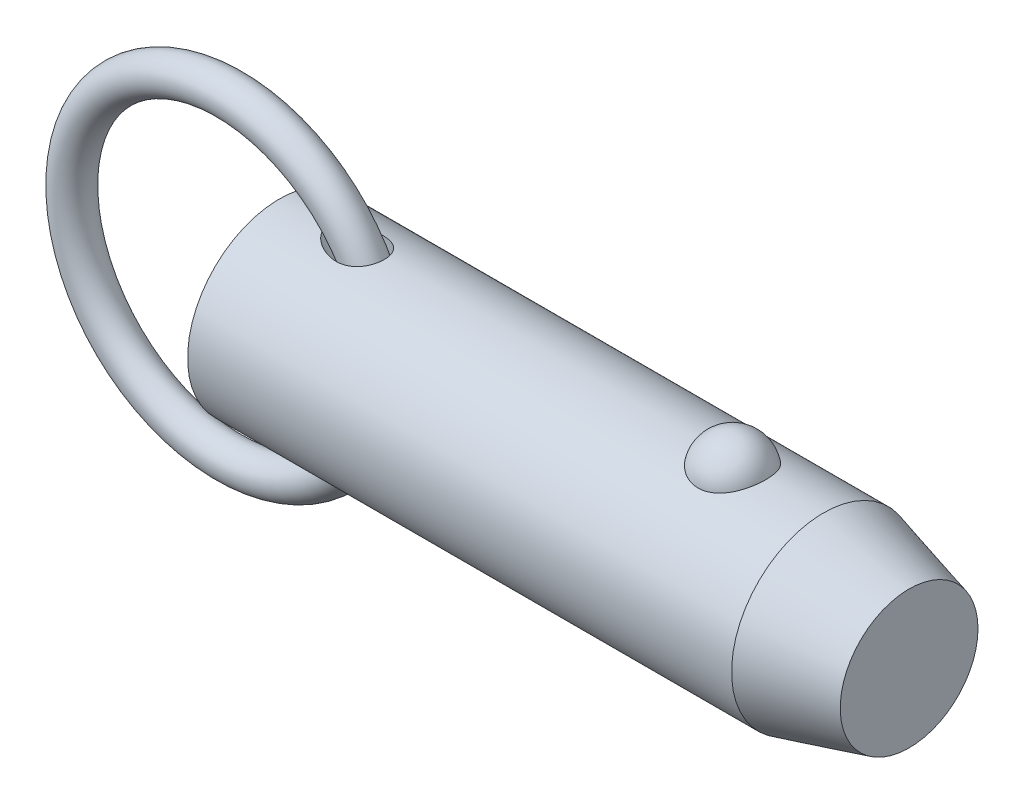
ISO-10303-21;
HEADER;
FILE_DESCRIPTION(('STEP AP214'),'2;1');
FILE_NAME('part.step','',(''),(''),'','','');
FILE_SCHEMA(('AUTOMOTIVE_DESIGN { 1 0 10303 214 1 1 1 1 }'));
ENDSEC;
DATA;
#1=APPLICATION_CONTEXT('core data for automotive mechanical design processes');
#2=APPLICATION_PROTOCOL_DEFINITION('international standard','automotive_design',2000,#1);
#3=PRODUCT_CONTEXT('',#1,'mechanical');
#4=PRODUCT('Part','Part','',(#3));
#5=PRODUCT_RELATED_PRODUCT_CATEGORY('part','',(#4));
#6=PRODUCT_DEFINITION_FORMATION('','',#4);
#7=PRODUCT_DEFINITION_CONTEXT('part definition',#1,'design');
#8=PRODUCT_DEFINITION('design','',#6,#7);
#9=PRODUCT_DEFINITION_SHAPE('','',#8);
#10=(LENGTH_UNIT() NAMED_UNIT(*) SI_UNIT(.MILLI.,.METRE.));
#11=(NAMED_UNIT(*) PLANE_ANGLE_UNIT() SI_UNIT($,.RADIAN.));
#12=(NAMED_UNIT(*) SI_UNIT($,.STERADIAN.) SOLID_ANGLE_UNIT());
#13=UNCERTAINTY_MEASURE_WITH_UNIT(LENGTH_MEASURE(1.E-05),#10,'distance_accuracy_value','');
#14=(GEOMETRIC_REPRESENTATION_CONTEXT(3) GLOBAL_UNCERTAINTY_ASSIGNED_CONTEXT((#13)) GLOBAL_UNIT_ASSIGNED_CONTEXT((#10,
#11,#12)) REPRESENTATION_CONTEXT('',''));
#15=CARTESIAN_POINT('',(0.,0.,0.));
#16=DIRECTION('',(0.,0.,1.));
#17=DIRECTION('',(1.,0.,0.));
#18=AXIS2_PLACEMENT_3D('',#15,#16,#17);
#19=CARTESIAN_POINT('',(-6.08699288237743,0.,0.));
#20=DIRECTION('',(0.,0.,1.));
#21=DIRECTION('',(1.,0.,0.));
#22=AXIS2_PLACEMENT_3D('',#19,#20,#21);
#23=TOROIDAL_SURFACE('',#22,19.05,2.223);
#24=CARTESIAN_POINT('',(15.1860071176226,0.,0.));
#25=VERTEX_POINT('',#24);
#26=VERTEX_LOOP('',#25);
#27=FACE_BOUND('',#26,.T.);
#28=ADVANCED_FACE('P0_F12',(#27),#23,.T.);
#29=CLOSED_SHELL('',(#28));
#30=MANIFOLD_SOLID_BREP('P0_B1',#29);
#31=CARTESIAN_POINT('',(0.,0.,0.));
#32=DIRECTION('',(1.,0.,0.));
#33=DIRECTION('',(0.,0.,-1.));
#34=AXIS2_PLACEMENT_3D('',#31,#32,#33);
#35=CYLINDRICAL_SURFACE('',#34,11.115);
#36=CARTESIAN_POINT('',(6.414051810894,11.0227946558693,-1.4287136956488));
#37=CARTESIAN_POINT('',(6.49338916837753,11.0115377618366,-1.51556642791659));
#38=CARTESIAN_POINT('',(6.57765461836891,10.9998263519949,-1.59789397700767));
#39=CARTESIAN_POINT('',(6.75386647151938,10.9760304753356,-1.75391400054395));
#40=CARTESIAN_POINT('',(6.84582247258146,10.9639455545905,-1.82759540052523));
#41=CARTESIAN_POINT('',(7.03627827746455,10.9397989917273,-1.96698954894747));
#42=CARTESIAN_POINT('',(7.13480838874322,10.9277377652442,-2.03266078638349));
#43=CARTESIAN_POINT('',(7.33681032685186,10.9041015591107,-2.1558582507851));
#44=CARTESIAN_POINT('',(7.44028007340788,10.8925263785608,-2.21338786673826));
#45=CARTESIAN_POINT('',(7.64386117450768,10.8710104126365,-2.31666528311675));
#46=CARTESIAN_POINT('',(7.74368989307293,10.8610119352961,-2.36295942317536));
#47=CARTESIAN_POINT('',(7.94637195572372,10.8420168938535,-2.44863486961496));
#48=CARTESIAN_POINT('',(8.04922612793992,10.8330206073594,-2.48801426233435));
#49=CARTESIAN_POINT('',(8.36115573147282,10.807980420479,-2.59542730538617));
#50=CARTESIAN_POINT('',(8.57411849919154,10.7938278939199,-2.65299817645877));
#51=CARTESIAN_POINT('',(9.00825016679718,10.7725818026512,-2.73800108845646));
#52=CARTESIAN_POINT('',(9.22947335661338,10.7655491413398,-2.76517330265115));
#53=CARTESIAN_POINT('',(9.67368141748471,10.7605872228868,-2.78445308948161));
#54=CARTESIAN_POINT('',(9.89666486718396,10.7626512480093,-2.77658653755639));
#55=CARTESIAN_POINT('',(10.2950172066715,10.7754452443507,-2.72644436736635));
#56=CARTESIAN_POINT('',(10.4712789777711,10.7844280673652,-2.69109376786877));
#57=CARTESIAN_POINT('',(10.7292776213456,10.8024982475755,-2.61722365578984));
#58=CARTESIAN_POINT('',(10.8142337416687,10.8092901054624,-2.58911576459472));
#59=CARTESIAN_POINT('',(10.9813218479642,10.8242580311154,-2.52581287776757));
#60=CARTESIAN_POINT('',(11.0634550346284,10.8324335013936,-2.49062094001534));
#61=CARTESIAN_POINT('',(11.2247418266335,10.8500287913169,-2.41281958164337));
#62=CARTESIAN_POINT('',(11.3038694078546,10.8594572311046,-2.37015806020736));
#63=CARTESIAN_POINT('',(11.4576781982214,10.8792243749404,-2.27770403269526));
#64=CARTESIAN_POINT('',(11.5323615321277,10.8895626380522,-2.22791497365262));
#65=CARTESIAN_POINT('',(11.6765388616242,10.9108113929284,-2.12140590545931));
#66=CARTESIAN_POINT('',(11.7460329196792,10.9217218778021,-2.06468597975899));
#67=CARTESIAN_POINT('',(11.8790597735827,10.9437207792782,-1.94471764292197));
#68=CARTESIAN_POINT('',(11.9425932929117,10.9548091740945,-1.88147002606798));
#69=CARTESIAN_POINT('',(12.109388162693,10.9851999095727,-1.69784918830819));
#70=CARTESIAN_POINT('',(12.205655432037,11.0042655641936,-1.57093023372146));
#71=CARTESIAN_POINT('',(12.374151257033,11.0393391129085,-1.3017676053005));
#72=CARTESIAN_POINT('',(12.4463875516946,11.0553479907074,-1.15952888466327));
#73=CARTESIAN_POINT('',(12.5615818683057,11.0816338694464,-0.87197217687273));
#74=CARTESIAN_POINT('',(12.6058896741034,11.0921698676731,-0.727217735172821));
#75=CARTESIAN_POINT('',(12.6699315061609,11.1075802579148,-0.432089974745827));
#76=CARTESIAN_POINT('',(12.6896681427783,11.1124552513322,-0.281717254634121));
#77=CARTESIAN_POINT('',(12.7040225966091,11.1159901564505,0.0188164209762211));
#78=CARTESIAN_POINT('',(12.6988836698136,11.1147102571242,0.168965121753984));
#79=CARTESIAN_POINT('',(12.6641681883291,11.1062126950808,0.466238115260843));
#80=CARTESIAN_POINT('',(12.6345920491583,11.0989951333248,0.613362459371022));
#81=CARTESIAN_POINT('',(12.5517453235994,11.0794095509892,0.900330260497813));
#82=CARTESIAN_POINT('',(12.4984878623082,11.0670443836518,1.0401777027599));
#83=CARTESIAN_POINT('',(12.3696588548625,11.0385082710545,1.308745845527));
#84=CARTESIAN_POINT('',(12.2940887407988,11.0223375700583,1.43746725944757));
#85=CARTESIAN_POINT('',(12.122380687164,10.987872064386,1.68079704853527));
#86=CARTESIAN_POINT('',(12.0261637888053,10.969569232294,1.79534850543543));
#87=CARTESIAN_POINT('',(11.8161707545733,10.932836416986,2.00695695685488));
#88=CARTESIAN_POINT('',(11.7023941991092,10.9144064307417,2.10401353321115));
#89=CARTESIAN_POINT('',(11.4575656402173,10.8788057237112,2.2810532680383));
#90=CARTESIAN_POINT('',(11.3261451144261,10.8616794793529,2.36053412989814));
#91=CARTESIAN_POINT('',(11.0523589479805,10.8308019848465,2.49839044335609));
#92=CARTESIAN_POINT('',(10.9099908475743,10.8170514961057,2.55676113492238));
#93=CARTESIAN_POINT('',(10.6060622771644,10.7929728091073,2.65666105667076));
#94=CARTESIAN_POINT('',(10.4438877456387,10.7830209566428,2.69640163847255));
#95=CARTESIAN_POINT('',(10.1154037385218,10.7687230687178,2.75293129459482));
#96=CARTESIAN_POINT('',(9.94909141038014,10.7643810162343,2.76970406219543));
#97=CARTESIAN_POINT('',(9.54387061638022,10.7604809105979,2.7848723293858));
#98=CARTESIAN_POINT('',(9.30446860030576,10.7637793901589,2.77227753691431));
#99=CARTESIAN_POINT('',(8.94961255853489,10.7757341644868,2.72524141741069));
#100=CARTESIAN_POINT('',(8.83186896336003,10.7808994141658,2.70482239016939));
#101=CARTESIAN_POINT('',(8.59835142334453,10.7932548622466,2.65509992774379));
#102=CARTESIAN_POINT('',(8.48257728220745,10.8004448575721,2.62579738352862));
#103=CARTESIAN_POINT('',(8.2520846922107,10.8166382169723,2.55827624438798));
#104=CARTESIAN_POINT('',(8.1374021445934,10.8256649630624,2.51994155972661));
#105=CARTESIAN_POINT('',(7.91132058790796,10.8451170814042,2.43486475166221));
#106=CARTESIAN_POINT('',(7.79992154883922,10.8555424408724,2.38812270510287));
#107=CARTESIAN_POINT('',(7.58115677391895,10.8774251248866,2.28638483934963));
#108=CARTESIAN_POINT('',(7.47378802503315,10.8888816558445,2.2313953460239));
#109=CARTESIAN_POINT('',(7.26385624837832,10.9124540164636,2.11310265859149));
#110=CARTESIAN_POINT('',(7.16129168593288,10.9245696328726,2.04980214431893));
#111=CARTESIAN_POINT('',(6.91882218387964,10.9543689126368,1.88540538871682));
#112=CARTESIAN_POINT('',(6.78193778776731,10.9721958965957,1.77979827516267));
#113=CARTESIAN_POINT('',(6.52472441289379,11.0070222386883,1.5498969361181));
#114=CARTESIAN_POINT('',(6.40436902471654,11.0240228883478,1.42563320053));
#115=CARTESIAN_POINT('',(6.21838804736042,11.0509658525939,1.19529359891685));
#116=CARTESIAN_POINT('',(6.14691885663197,11.0615430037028,1.09404520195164));
#117=CARTESIAN_POINT('',(6.02043496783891,11.0805004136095,0.881508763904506));
#118=CARTESIAN_POINT('',(5.96539400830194,11.0888841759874,0.770237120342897));
#119=CARTESIAN_POINT('',(5.88475453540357,11.1012553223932,0.560577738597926));
#120=CARTESIAN_POINT('',(5.85559643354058,11.1057686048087,0.463603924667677));
#121=CARTESIAN_POINT('',(5.81381299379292,11.1122523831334,0.26608330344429));
#122=CARTESIAN_POINT('',(5.80117118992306,11.1142254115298,0.165540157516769));
#123=CARTESIAN_POINT('',(5.79363815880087,11.1153999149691,-0.0364747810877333));
#124=CARTESIAN_POINT('',(5.79878799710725,11.1145949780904,-0.137948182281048));
#125=CARTESIAN_POINT('',(5.82639592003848,11.1102987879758,-0.338493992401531));
#126=CARTESIAN_POINT('',(5.84887234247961,11.1068046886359,-0.437563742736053));
#127=CARTESIAN_POINT('',(5.91510741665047,11.0965857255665,-0.649968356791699));
#128=CARTESIAN_POINT('',(5.9622090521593,11.0893566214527,-0.762222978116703));
#129=CARTESIAN_POINT('',(6.07378449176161,11.072471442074,-0.977396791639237));
#130=CARTESIAN_POINT('',(6.13826787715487,11.0628140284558,-1.08031079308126));
#131=CARTESIAN_POINT('',(6.24101077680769,11.0477136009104,-1.2219580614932));
#132=CARTESIAN_POINT('',(6.27403486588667,11.042895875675,-1.26469183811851));
#133=CARTESIAN_POINT('',(6.34238022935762,11.0330152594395,-1.34817011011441));
#134=CARTESIAN_POINT('',(6.37769867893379,11.0279526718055,-1.38891694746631));
#135=CARTESIAN_POINT('',(6.414051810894,11.0227946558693,-1.4287136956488));
#136=B_SPLINE_CURVE_WITH_KNOTS('',3,(#36,#37,#38,#39,#40,#41,#42,#43,#44,#45,#46,#47,#48,#49,
#50,#51,#52,#53,#54,#55,#56,#57,#58,#59,#60,#61,#62,#63,#64,#65,#66,#67,#68,#69,#70,#71,#72,#73,
#74,#75,#76,#77,#78,#79,#80,#81,#82,#83,#84,#85,#86,#87,#88,#89,#90,#91,#92,#93,#94,#95,#96,#97,
#98,#99,#100,#101,#102,#103,#104,#105,#106,#107,#108,#109,#110,#111,#112,#113,#114,#115,#116,
#117,#118,#119,#120,#121,#122,#123,#124,#125,#126,#127,#128,#129,#130,#131,#132,#133,#134,#135),
.UNSPECIFIED.,.T.,.F.,(4,2,2,2,2,2,2,2,2,2,2,2,2,2,2,2,2,2,2,2,2,2,2,2,2,2,2,2,2,2,2,2,2,2,2,2,
2,2,2,2,2,2,2,2,2,2,2,2,2,4),(0.,0.35443329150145,0.709315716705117,1.0659654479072,
1.42246628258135,1.7536715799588,2.08496839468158,2.74582009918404,3.41227815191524,
4.07824412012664,4.61583787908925,4.88478112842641,5.1536085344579,5.42439170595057,
5.69504436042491,5.96569375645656,6.23631025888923,6.71490729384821,7.19335005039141,
7.64641437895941,8.09943057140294,8.54802575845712,8.99661331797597,9.44495256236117,
9.89326303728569,10.3433195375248,10.7933867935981,11.2550086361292,11.7167345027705,
12.2165866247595,12.7167934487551,13.4318876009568,13.7904664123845,14.1490092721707,
14.5124394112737,14.8758662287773,15.239015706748,15.6020483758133,16.1219860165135,
16.6410830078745,17.0130520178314,17.3844231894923,17.6872330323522,17.9897407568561,
18.2929471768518,18.5964749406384,18.9603532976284,19.3244326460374,19.4870338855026,
19.649438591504),.UNSPECIFIED.);
#137=CARTESIAN_POINT('',(6.414051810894,11.0227946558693,-1.4287136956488));
#138=VERTEX_POINT('',#137);
#139=EDGE_CURVE('P1_E40',#138,#138,#136,.T.);
#140=ORIENTED_EDGE('',*,*,#139,.T.);
#141=EDGE_LOOP('',(#140));
#142=FACE_BOUND('',#141,.T.);
#143=CARTESIAN_POINT('',(65.829563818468,0.,0.));
#144=DIRECTION('',(1.,0.,0.));
#145=DIRECTION('',(0.,0.,-1.));
#146=AXIS2_PLACEMENT_3D('',#143,#144,#145);
#147=CIRCLE('',#146,11.115);
#148=CARTESIAN_POINT('',(65.829563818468,0.,-11.115));
#149=VERTEX_POINT('',#148);
#150=EDGE_CURVE('P1_E25',#149,#149,#147,.T.);
#151=ORIENTED_EDGE('',*,*,#150,.F.);
#152=EDGE_LOOP('',(#151));
#153=FACE_BOUND('',#152,.T.);
#154=CARTESIAN_POINT('',(0.,0.,0.));
#155=DIRECTION('',(1.,0.,0.));
#156=DIRECTION('',(0.,0.,-1.));
#157=AXIS2_PLACEMENT_3D('',#154,#155,#156);
#158=CIRCLE('',#157,11.115);
#159=CARTESIAN_POINT('',(0.,0.,-11.115));
#160=VERTEX_POINT('',#159);
#161=EDGE_CURVE('P1_E9',#160,#160,#158,.T.);
#162=ORIENTED_EDGE('',*,*,#161,.T.);
#163=EDGE_LOOP('',(#162));
#164=FACE_BOUND('',#163,.T.);
#165=CARTESIAN_POINT('',(54.8310680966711,10.3028087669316,4.17077409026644));
#166=CARTESIAN_POINT('',(54.6147756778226,10.3028003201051,4.17078240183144));
#167=CARTESIAN_POINT('',(54.3985488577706,10.3098895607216,4.15340593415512));
#168=CARTESIAN_POINT('',(53.9725408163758,10.3373834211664,4.08449540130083));
#169=CARTESIAN_POINT('',(53.7627577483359,10.3577841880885,4.03297121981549));
#170=CARTESIAN_POINT('',(53.3557825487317,10.4095237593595,3.89746513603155));
#171=CARTESIAN_POINT('',(53.1585726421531,10.4408466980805,3.8135302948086));
#172=CARTESIAN_POINT('',(52.7813382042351,10.5110236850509,3.61560339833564));
#173=CARTESIAN_POINT('',(52.6013171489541,10.5498792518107,3.50160528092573));
#174=CARTESIAN_POINT('',(52.2576842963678,10.6322884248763,3.2429246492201));
#175=CARTESIAN_POINT('',(52.0946861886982,10.6759443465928,3.09746040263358));
#176=CARTESIAN_POINT('',(51.7945911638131,10.7625291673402,2.78171925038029));
#177=CARTESIAN_POINT('',(51.6574990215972,10.8054579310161,2.61143778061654));
#178=CARTESIAN_POINT('',(51.4064084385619,10.8881935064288,2.24226695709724));
#179=CARTESIAN_POINT('',(51.2937105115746,10.9277761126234,2.04244123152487));
#180=CARTESIAN_POINT('',(51.1017771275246,10.997484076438,1.62578254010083));
#181=CARTESIAN_POINT('',(51.022544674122,11.0276085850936,1.40894804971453));
#182=CARTESIAN_POINT('',(50.8983034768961,11.0756732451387,0.961250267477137));
#183=CARTESIAN_POINT('',(50.853760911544,11.0934470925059,0.730239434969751));
#184=CARTESIAN_POINT('',(50.8015695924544,11.1143331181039,0.263439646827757));
#185=CARTESIAN_POINT('',(50.7939200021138,11.1174456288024,0.0276507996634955));
#186=CARTESIAN_POINT('',(50.8156105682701,11.1087161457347,-0.440729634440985));
#187=CARTESIAN_POINT('',(50.8447624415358,11.0969502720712,-0.673331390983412));
#188=CARTESIAN_POINT('',(50.9391432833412,11.0597872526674,-1.12996621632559));
#189=CARTESIAN_POINT('',(51.0043729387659,11.0343898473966,-1.35399912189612));
#190=CARTESIAN_POINT('',(51.1696984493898,10.972515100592,-1.78750286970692));
#191=CARTESIAN_POINT('',(51.2698386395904,10.9360236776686,-1.99695478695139));
#192=CARTESIAN_POINT('',(51.5029408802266,10.8557595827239,-2.39520667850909));
#193=CARTESIAN_POINT('',(51.6359054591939,10.8119863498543,-2.5840050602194));
#194=CARTESIAN_POINT('',(51.932407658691,10.7216733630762,-2.93635726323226));
#195=CARTESIAN_POINT('',(52.0960565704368,10.675123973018,-3.09981510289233));
#196=CARTESIAN_POINT('',(52.4498601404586,10.5846571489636,-3.39592247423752));
#197=CARTESIAN_POINT('',(52.6400123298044,10.5407394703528,-3.52857487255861));
#198=CARTESIAN_POINT('',(53.0375014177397,10.4616690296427,-3.75646057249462));
#199=CARTESIAN_POINT('',(53.2443670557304,10.4263443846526,-3.8524543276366));
#200=CARTESIAN_POINT('',(53.6729541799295,10.3675574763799,-4.00798747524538));
#201=CARTESIAN_POINT('',(53.894670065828,10.344090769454,-4.0675405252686));
#202=CARTESIAN_POINT('',(54.3346695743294,10.3128282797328,-4.14614314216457));
#203=CARTESIAN_POINT('',(54.5525654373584,10.3043040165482,-4.16707833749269));
#204=CARTESIAN_POINT('',(54.9889495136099,10.3016771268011,-4.17357158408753));
#205=CARTESIAN_POINT('',(55.2074376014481,10.3075716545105,-4.15913661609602));
#206=CARTESIAN_POINT('',(55.6317442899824,10.3326686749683,-4.09636961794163));
#207=CARTESIAN_POINT('',(55.8377458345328,10.3514555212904,-4.0490957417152));
#208=CARTESIAN_POINT('',(56.2385764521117,10.399818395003,-3.92320197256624));
#209=CARTESIAN_POINT('',(56.4334046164,10.4293952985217,-3.84457953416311));
#210=CARTESIAN_POINT('',(56.8111917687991,10.4969600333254,-3.65612410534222));
#211=CARTESIAN_POINT('',(56.9937974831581,10.5351178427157,-3.54564545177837));
#212=CARTESIAN_POINT('',(57.3382040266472,10.6154999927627,-3.29718036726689));
#213=CARTESIAN_POINT('',(57.500000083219,10.657725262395,-3.15918764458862));
#214=CARTESIAN_POINT('',(57.8069596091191,10.744212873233,-2.85163580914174));
#215=CARTESIAN_POINT('',(57.9508919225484,10.7884718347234,-2.68084605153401));
#216=CARTESIAN_POINT('',(58.209237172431,10.872374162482,-2.3172186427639));
#217=CARTESIAN_POINT('',(58.3236448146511,10.9120167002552,-2.12437704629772));
#218=CARTESIAN_POINT('',(58.5238739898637,10.9838919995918,-1.71516999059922));
#219=CARTESIAN_POINT('',(58.6086617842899,11.0158465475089,-1.498248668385));
#220=CARTESIAN_POINT('',(58.7426838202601,11.0673523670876,-1.052285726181));
#221=CARTESIAN_POINT('',(58.7919174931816,11.086903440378,-0.823243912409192));
#222=CARTESIAN_POINT('',(58.8538915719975,11.1116323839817,-0.359087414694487));
#223=CARTESIAN_POINT('',(58.8665662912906,11.1167843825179,-0.123962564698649));
#224=CARTESIAN_POINT('',(58.854973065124,11.1121144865,0.345220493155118));
#225=CARTESIAN_POINT('',(58.8307056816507,11.1022928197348,0.579278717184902));
#226=CARTESIAN_POINT('',(58.7459073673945,11.0687504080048,1.03866534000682));
#227=CARTESIAN_POINT('',(58.6855299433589,11.0450885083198,1.26402641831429));
#228=CARTESIAN_POINT('',(58.5298532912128,10.9863185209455,1.70076772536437));
#229=CARTESIAN_POINT('',(58.434551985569,10.9512097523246,1.91214712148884));
#230=CARTESIAN_POINT('',(58.2103974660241,10.8729733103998,2.31608359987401));
#231=CARTESIAN_POINT('',(58.0813806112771,10.8298068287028,2.50854240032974));
#232=CARTESIAN_POINT('',(57.7927327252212,10.7401896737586,2.86808766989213));
#233=CARTESIAN_POINT('',(57.6331022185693,10.6937390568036,3.03517457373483));
#234=CARTESIAN_POINT('',(57.2875341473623,10.6029321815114,3.33857581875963));
#235=CARTESIAN_POINT('',(57.1017089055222,10.5585680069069,3.47501541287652));
#236=CARTESIAN_POINT('',(56.7078750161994,10.4769321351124,3.71390897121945));
#237=CARTESIAN_POINT('',(56.4998635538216,10.439661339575,3.81635861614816));
#238=CARTESIAN_POINT('',(56.0540666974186,10.3749407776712,3.98910631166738));
#239=CARTESIAN_POINT('',(55.8152342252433,10.3482457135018,4.05700929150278));
#240=CARTESIAN_POINT('',(55.3279254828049,10.312188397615,4.14782844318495));
#241=CARTESIAN_POINT('',(55.0794535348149,10.3028184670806,4.17076454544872));
#242=CARTESIAN_POINT('',(54.8310680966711,10.3028087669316,4.17077409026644));
#243=B_SPLINE_CURVE_WITH_KNOTS('',3,(#165,#166,#167,#168,#169,#170,#171,#172,#173,#174,#175,
#176,#177,#178,#179,#180,#181,#182,#183,#184,#185,#186,#187,#188,#189,#190,#191,#192,#193,#194,
#195,#196,#197,#198,#199,#200,#201,#202,#203,#204,#205,#206,#207,#208,#209,#210,#211,#212,#213,
#214,#215,#216,#217,#218,#219,#220,#221,#222,#223,#224,#225,#226,#227,#228,#229,#230,#231,#232,
#233,#234,#235,#236,#237,#238,#239,#240,#241,#242),.UNSPECIFIED.,.T.,.F.,(4,2,2,2,2,2,2,2,2,2,2,
2,2,2,2,2,2,2,2,2,2,2,2,2,2,2,2,2,2,2,2,2,2,2,2,2,2,2,4),(0.,0.647966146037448,1.29574482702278,
1.94258643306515,2.58955857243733,3.25496465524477,3.92049326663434,4.61566368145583,
5.31089647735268,6.01531821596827,6.71972398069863,7.42054043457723,8.12137023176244,
8.8230933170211,9.52487047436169,10.2292439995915,10.9335519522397,11.6223330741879,
12.3108558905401,12.9647664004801,13.6185478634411,14.252184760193,14.8858731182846,
15.5334360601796,16.1811472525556,16.8611459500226,17.5412664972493,18.2431855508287,
18.9451158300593,19.6483065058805,20.3514864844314,21.0516982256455,21.7519516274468,
22.4556690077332,23.1593743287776,23.860149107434,24.5610129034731,25.3054529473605,
26.049562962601),.UNSPECIFIED.);
#244=CARTESIAN_POINT('',(54.8310680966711,10.3028087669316,4.17077409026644));
#245=VERTEX_POINT('',#244);
#246=EDGE_CURVE('P1_E34',#245,#245,#243,.T.);
#247=ORIENTED_EDGE('',*,*,#246,.T.);
#248=EDGE_LOOP('',(#247));
#249=FACE_BOUND('',#248,.T.);
#250=CARTESIAN_POINT('',(6.414051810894,-11.0227946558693,-1.4287136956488));
#251=CARTESIAN_POINT('',(6.33124061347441,-11.0345445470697,-1.33806125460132));
#252=CARTESIAN_POINT('',(6.25372866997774,-11.0458090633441,-1.24240732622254));
#253=CARTESIAN_POINT('',(6.11277905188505,-11.0666115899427,-1.04095704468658));
#254=CARTESIAN_POINT('',(6.04933920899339,-11.0761498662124,-0.935162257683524));
#255=CARTESIAN_POINT('',(5.94029181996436,-11.0927063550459,-0.712476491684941));
#256=CARTESIAN_POINT('',(5.89492964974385,-11.0996897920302,-0.595457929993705));
#257=CARTESIAN_POINT('',(5.8449816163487,-11.1074141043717,-0.414997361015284));
#258=CARTESIAN_POINT('',(5.83135004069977,-11.1095300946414,-0.354047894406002));
#259=CARTESIAN_POINT('',(5.81051649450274,-11.1127688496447,-0.231041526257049));
#260=CARTESIAN_POINT('',(5.80331311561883,-11.1138918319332,-0.1689848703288));
#261=CARTESIAN_POINT('',(5.79296529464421,-11.1155042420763,-0.000484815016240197));
#262=CARTESIAN_POINT('',(5.79625267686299,-11.1149904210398,0.106437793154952));
#263=CARTESIAN_POINT('',(5.82213676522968,-11.1109609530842,0.317809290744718));
#264=CARTESIAN_POINT('',(5.84474662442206,-11.1074432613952,0.422256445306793));
#265=CARTESIAN_POINT('',(5.91113114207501,-11.097197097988,0.639361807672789));
#266=CARTESIAN_POINT('',(5.95733120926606,-11.090102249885,0.751250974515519));
#267=CARTESIAN_POINT('',(6.06709542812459,-11.0734770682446,0.965912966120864));
#268=CARTESIAN_POINT('',(6.13068735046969,-11.06394284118,1.06867085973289));
#269=CARTESIAN_POINT('',(6.30294237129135,-11.0385920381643,1.30890635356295));
#270=CARTESIAN_POINT('',(6.4189620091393,-11.0218881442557,1.44097376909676));
#271=CARTESIAN_POINT('',(6.66989654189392,-10.9871512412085,1.68553954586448));
#272=CARTESIAN_POINT('',(6.80485520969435,-10.9691152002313,1.79799117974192));
#273=CARTESIAN_POINT('',(7.04881236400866,-10.9382283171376,1.97587596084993));
#274=CARTESIAN_POINT('',(7.15465712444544,-10.9253240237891,2.04570822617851));
#275=CARTESIAN_POINT('',(7.37202504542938,-10.9000987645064,2.17611840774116));
#276=CARTESIAN_POINT('',(7.48355057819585,-10.8877780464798,2.23669241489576));
#277=CARTESIAN_POINT('',(7.71132418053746,-10.8641580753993,2.34873831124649));
#278=CARTESIAN_POINT('',(7.82757727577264,-10.8528599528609,2.40020018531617));
#279=CARTESIAN_POINT('',(8.06386825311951,-10.8317234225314,2.49385169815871));
#280=CARTESIAN_POINT('',(8.18390558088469,-10.8218848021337,2.53604268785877));
#281=CARTESIAN_POINT('',(8.42918336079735,-10.8039208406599,2.61152283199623));
#282=CARTESIAN_POINT('',(8.55447802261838,-10.7958283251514,2.64464414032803));
#283=CARTESIAN_POINT('',(8.80752127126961,-10.781995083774,2.70048793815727));
#284=CARTESIAN_POINT('',(8.93527019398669,-10.7762546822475,2.72320899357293));
#285=CARTESIAN_POINT('',(9.19210176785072,-10.7675291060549,2.75750994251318));
#286=CARTESIAN_POINT('',(9.32118105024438,-10.7645381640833,2.76911315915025));
#287=CARTESIAN_POINT('',(9.57984338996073,-10.761622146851,2.78042035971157));
#288=CARTESIAN_POINT('',(9.70942621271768,-10.7616957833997,2.78012934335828));
#289=CARTESIAN_POINT('',(10.0243125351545,-10.7659059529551,2.76381534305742));
#290=CARTESIAN_POINT('',(10.209307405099,-10.7717977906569,2.74099674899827));
#291=CARTESIAN_POINT('',(10.5731188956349,-10.7905408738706,2.66626238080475));
#292=CARTESIAN_POINT('',(10.7519389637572,-10.8033881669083,2.61436313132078));
#293=CARTESIAN_POINT('',(11.0114289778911,-10.8271584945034,2.51336808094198));
#294=CARTESIAN_POINT('',(11.0968318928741,-10.835881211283,2.47562331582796));
#295=CARTESIAN_POINT('',(11.2636000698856,-10.8545688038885,2.39236170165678));
#296=CARTESIAN_POINT('',(11.344967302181,-10.8645330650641,2.34684869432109));
#297=CARTESIAN_POINT('',(11.5027832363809,-10.8853818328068,2.24815967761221));
#298=CARTESIAN_POINT('',(11.5792327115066,-10.8962661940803,2.19498487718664));
#299=CARTESIAN_POINT('',(11.7263315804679,-10.9185541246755,2.08128855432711));
#300=CARTESIAN_POINT('',(11.7969818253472,-10.9299576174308,2.02076811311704));
#301=CARTESIAN_POINT('',(11.9817953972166,-10.9613645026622,1.84513663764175));
#302=CARTESIAN_POINT('',(12.0893012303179,-10.9814643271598,1.72286660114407));
#303=CARTESIAN_POINT('',(12.2803576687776,-11.0193991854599,1.46066991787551));
#304=CARTESIAN_POINT('',(12.3639173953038,-11.0372350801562,1.32075002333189));
#305=CARTESIAN_POINT('',(12.4996220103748,-11.0672969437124,1.03778067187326));
#306=CARTESIAN_POINT('',(12.5535315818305,-11.0798242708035,0.895607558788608));
#307=CARTESIAN_POINT('',(12.636874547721,-11.0995427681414,0.603918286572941));
#308=CARTESIAN_POINT('',(12.6663115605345,-11.1067347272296,0.454403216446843));
#309=CARTESIAN_POINT('',(12.6997387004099,-11.1149224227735,0.154577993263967));
#310=CARTESIAN_POINT('',(12.7040886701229,-11.1160057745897,0.00431019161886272));
#311=CARTESIAN_POINT('',(12.6882048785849,-11.1120956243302,-0.294841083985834));
#312=CARTESIAN_POINT('',(12.6679715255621,-11.1071022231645,-0.443724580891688));
#313=CARTESIAN_POINT('',(12.6034470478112,-11.0915888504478,-0.735688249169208));
#314=CARTESIAN_POINT('',(12.5591858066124,-11.0810757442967,-0.878775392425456));
#315=CARTESIAN_POINT('',(12.4477416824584,-11.0556687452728,-1.1552952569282));
#316=CARTESIAN_POINT('',(12.3805601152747,-11.0407751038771,-1.28872853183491));
#317=CARTESIAN_POINT('',(12.2248919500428,-11.0081839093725,-1.54257976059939));
#318=CARTESIAN_POINT('',(12.1363549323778,-10.9904797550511,-1.66296592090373));
#319=CARTESIAN_POINT('',(11.9406137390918,-10.9541951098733,-1.88726577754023));
#320=CARTESIAN_POINT('',(11.833409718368,-10.9356146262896,-1.99117961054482));
#321=CARTESIAN_POINT('',(11.601318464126,-10.8991360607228,-2.18213646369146));
#322=CARTESIAN_POINT('',(11.4761325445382,-10.8812577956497,-2.26881927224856));
#323=CARTESIAN_POINT('',(11.2134852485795,-10.8482871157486,-2.42157282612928));
#324=CARTESIAN_POINT('',(11.0760218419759,-10.8331951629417,-2.48764015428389));
#325=CARTESIAN_POINT('',(10.7828968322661,-10.8061050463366,-2.60290068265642));
#326=CARTESIAN_POINT('',(10.6266338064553,-10.7943907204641,-2.65062248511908));
#327=CARTESIAN_POINT('',(10.3086617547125,-10.7762429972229,-2.72345054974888));
#328=CARTESIAN_POINT('',(10.146948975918,-10.7698133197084,-2.74854088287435));
#329=CARTESIAN_POINT('',(9.75541304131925,-10.7608036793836,-2.78368719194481));
#330=CARTESIAN_POINT('',(9.52459435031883,-10.7608467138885,-2.78350276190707));
#331=CARTESIAN_POINT('',(9.0660496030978,-10.7702674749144,-2.74677945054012));
#332=CARTESIAN_POINT('',(8.83832966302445,-10.7796615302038,-2.71017697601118));
#333=CARTESIAN_POINT('',(8.38783466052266,-10.8058248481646,-2.60392490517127));
#334=CARTESIAN_POINT('',(8.16517101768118,-10.8226939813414,-2.53382676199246));
#335=CARTESIAN_POINT('',(7.84087311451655,-10.8516548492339,-2.40555545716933));
#336=CARTESIAN_POINT('',(7.73435551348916,-10.8619221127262,-2.35892455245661));
#337=CARTESIAN_POINT('',(7.52510420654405,-10.883357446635,-2.25797017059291));
#338=CARTESIAN_POINT('',(7.42236986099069,-10.8945253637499,-2.20364800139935));
#339=CARTESIAN_POINT('',(7.23808758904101,-10.915528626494,-2.09688018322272));
#340=CARTESIAN_POINT('',(7.15584631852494,-10.9252787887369,-2.04561072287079));
#341=CARTESIAN_POINT('',(6.99510576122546,-10.944960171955,-1.93754729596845));
#342=CARTESIAN_POINT('',(6.91660574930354,-10.9548913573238,-1.88075440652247));
#343=CARTESIAN_POINT('',(6.76418133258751,-10.974690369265,-1.7615450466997));
#344=CARTESIAN_POINT('',(6.69024940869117,-10.984558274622,-1.69913825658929));
#345=CARTESIAN_POINT('',(6.54780119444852,-11.0039826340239,-1.56842485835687));
#346=CARTESIAN_POINT('',(6.47928247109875,-11.0135392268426,-1.50012092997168));
#347=CARTESIAN_POINT('',(6.414051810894,-11.0227946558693,-1.4287136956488));
#348=B_SPLINE_CURVE_WITH_KNOTS('',3,(#250,#251,#252,#253,#254,#255,#256,#257,#258,#259,#260,
#261,#262,#263,#264,#265,#266,#267,#268,#269,#270,#271,#272,#273,#274,#275,#276,#277,#278,#279,
#280,#281,#282,#283,#284,#285,#286,#287,#288,#289,#290,#291,#292,#293,#294,#295,#296,#297,#298,
#299,#300,#301,#302,#303,#304,#305,#306,#307,#308,#309,#310,#311,#312,#313,#314,#315,#316,#317,
#318,#319,#320,#321,#322,#323,#324,#325,#326,#327,#328,#329,#330,#331,#332,#333,#334,#335,#336,
#337,#338,#339,#340,#341,#342,#343,#344,#345,#346,#347),.UNSPECIFIED.,.T.,.F.,(4,2,2,2,2,2,2,2,
2,2,2,2,2,2,2,2,2,2,2,2,2,2,2,2,2,2,2,2,2,2,2,2,2,2,2,2,2,2,2,2,2,2,2,2,2,2,2,2,4),(0.,
0.36983565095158,0.739614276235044,1.1142538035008,1.30141910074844,1.48854338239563,
1.8074587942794,2.12659146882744,2.4883888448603,2.85076733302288,3.3776216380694,
3.90571433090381,4.287639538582,4.66972556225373,5.05222896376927,5.43467659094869,
5.82378546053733,6.21294796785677,6.6012922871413,6.98947336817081,7.54669558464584,
8.10360148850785,8.3845853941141,8.66543074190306,8.94623182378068,9.22699162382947,
9.71628887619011,10.2053995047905,10.6608871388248,11.1163074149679,11.5651786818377,
12.0140424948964,12.4623493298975,12.9106304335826,13.3599804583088,13.8093267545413,
14.2672570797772,14.7252632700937,15.214740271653,15.7045615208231,16.3932594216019,
17.083162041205,17.7825738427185,18.1325177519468,18.4824022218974,18.7744056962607,
19.0663523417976,19.3578048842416,19.6491256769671),.UNSPECIFIED.);
#349=CARTESIAN_POINT('',(6.414051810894,-11.0227946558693,-1.4287136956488));
#350=VERTEX_POINT('',#349);
#351=EDGE_CURVE('P1_E17',#350,#350,#348,.T.);
#352=ORIENTED_EDGE('',*,*,#351,.T.);
#353=EDGE_LOOP('',(#352));
#354=FACE_BOUND('',#353,.T.);
#355=ADVANCED_FACE('P1_F13',(#142,#153,#164,#249,#354),#35,.T.);
#356=CARTESIAN_POINT('',(0.,0.,0.));
#357=DIRECTION('',(-1.,0.,0.));
#358=DIRECTION('',(0.,0.,1.));
#359=AXIS2_PLACEMENT_3D('',#356,#357,#358);
#360=PLANE('',#359);
#361=ORIENTED_EDGE('',*,*,#161,.F.);
#362=EDGE_LOOP('',(#361));
#363=FACE_BOUND('',#362,.T.);
#364=ADVANCED_FACE('P1_F15',(#363),#360,.T.);
#365=CARTESIAN_POINT('',(76.2,0.,0.));
#366=DIRECTION('',(-1.,0.,0.));
#367=DIRECTION('',(0.,0.,1.));
#368=AXIS2_PLACEMENT_3D('',#365,#366,#367);
#369=CONICAL_SURFACE('',#368,8.33625000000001,0.26179938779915);
#370=ORIENTED_EDGE('',*,*,#150,.T.);
#371=EDGE_LOOP('',(#370));
#372=FACE_BOUND('',#371,.T.);
#373=CARTESIAN_POINT('',(76.2,0.,0.));
#374=DIRECTION('',(1.,0.,0.));
#375=DIRECTION('',(0.,0.,-1.));
#376=AXIS2_PLACEMENT_3D('',#373,#374,#375);
#377=CIRCLE('',#376,8.33625000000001);
#378=CARTESIAN_POINT('',(76.2,0.,-8.33625000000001));
#379=VERTEX_POINT('',#378);
#380=EDGE_CURVE('P1_E30',#379,#379,#377,.T.);
#381=ORIENTED_EDGE('',*,*,#380,.F.);
#382=EDGE_LOOP('',(#381));
#383=FACE_BOUND('',#382,.T.);
#384=ADVANCED_FACE('P1_F55',(#372,#383),#369,.T.);
#385=CARTESIAN_POINT('',(76.2,8.33625000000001,0.));
#386=DIRECTION('',(1.,0.,0.));
#387=DIRECTION('',(0.,0.,-1.));
#388=AXIS2_PLACEMENT_3D('',#385,#386,#387);
#389=PLANE('',#388);
#390=ORIENTED_EDGE('',*,*,#380,.T.);
#391=EDGE_LOOP('',(#390));
#392=FACE_BOUND('',#391,.T.);
#393=ADVANCED_FACE('P1_F51',(#392),#389,.T.);
#394=CARTESIAN_POINT('',(54.8310680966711,10.0035,0.));
#395=DIRECTION('',(-1.,0.,0.));
#396=DIRECTION('',(0.,1.,0.));
#397=AXIS2_PLACEMENT_3D('',#394,#395,#396);
#398=SPHERICAL_SURFACE('',#397,4.1815);
#399=ORIENTED_EDGE('',*,*,#246,.F.);
#400=EDGE_LOOP('',(#399));
#401=FACE_BOUND('',#400,.T.);
#402=ADVANCED_FACE('P1_F46',(#401),#398,.T.);
#403=CARTESIAN_POINT('',(-6.08699288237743,0.,0.));
#404=DIRECTION('',(0.,0.,1.));
#405=DIRECTION('',(1.,0.,0.));
#406=AXIS2_PLACEMENT_3D('',#403,#404,#405);
#407=TOROIDAL_SURFACE('',#406,19.05,2.77875);
#408=ORIENTED_EDGE('',*,*,#351,.F.);
#409=EDGE_LOOP('',(#408));
#410=FACE_BOUND('',#409,.T.);
#411=ORIENTED_EDGE('',*,*,#139,.F.);
#412=EDGE_LOOP('',(#411));
#413=FACE_BOUND('',#412,.T.);
#414=ADVANCED_FACE('P1_F50',(#410,#413),#407,.F.);
#415=CLOSED_SHELL('',(#355,#364,#384,#393,#402,#414));
#416=MANIFOLD_SOLID_BREP('P1_B1',#415);
#417=ADVANCED_BREP_SHAPE_REPRESENTATION('',(#18,#30,#416),#14);
#418=SHAPE_DEFINITION_REPRESENTATION(#9,#417);
ENDSEC;
END-ISO-10303-21;
